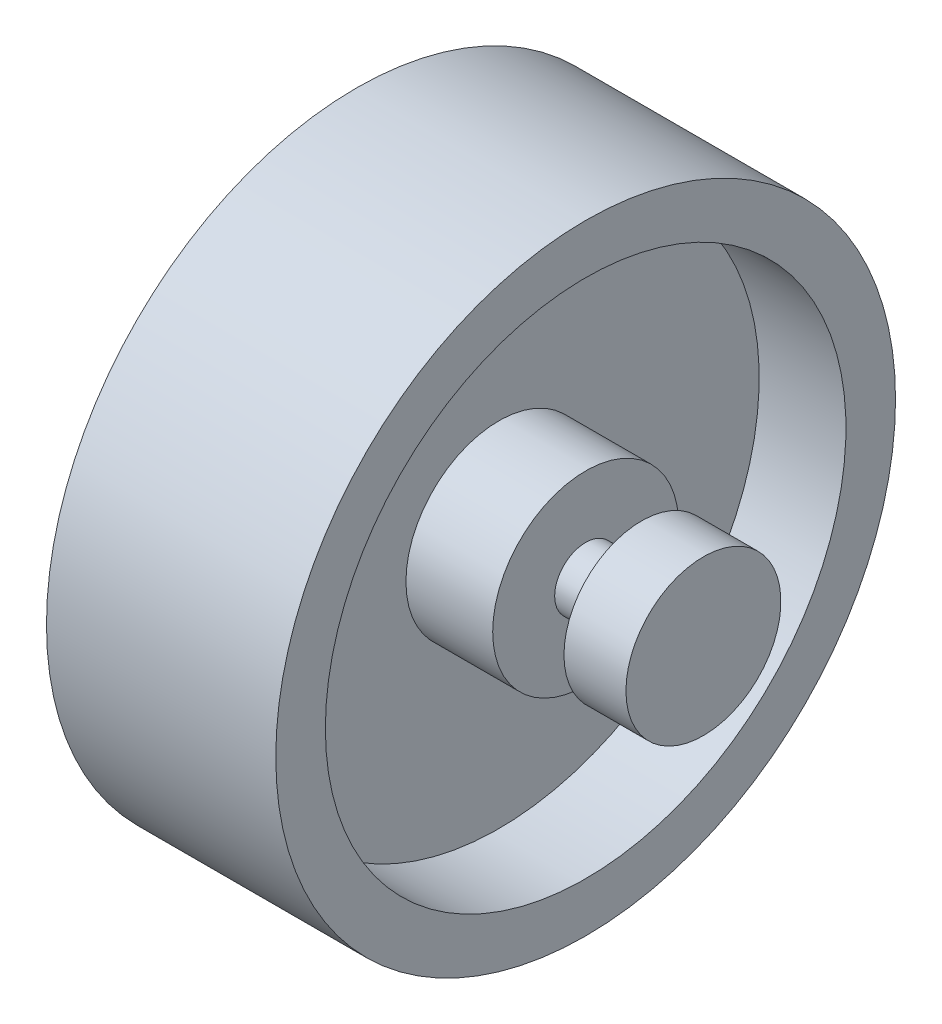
ISO-10303-21;
HEADER;
FILE_DESCRIPTION(('STEP AP214'),'2;1');
FILE_NAME('part.step','',(''),(''),'','','');
FILE_SCHEMA(('AUTOMOTIVE_DESIGN { 1 0 10303 214 1 1 1 1 }'));
ENDSEC;
DATA;
#1=APPLICATION_CONTEXT('core data for automotive mechanical design processes');
#2=APPLICATION_PROTOCOL_DEFINITION('international standard','automotive_design',2000,#1);
#3=PRODUCT_CONTEXT('',#1,'mechanical');
#4=PRODUCT('Part','Part','',(#3));
#5=PRODUCT_RELATED_PRODUCT_CATEGORY('part','',(#4));
#6=PRODUCT_DEFINITION_FORMATION('','',#4);
#7=PRODUCT_DEFINITION_CONTEXT('part definition',#1,'design');
#8=PRODUCT_DEFINITION('design','',#6,#7);
#9=PRODUCT_DEFINITION_SHAPE('','',#8);
#10=(LENGTH_UNIT() NAMED_UNIT(*) SI_UNIT(.MILLI.,.METRE.));
#11=(NAMED_UNIT(*) PLANE_ANGLE_UNIT() SI_UNIT($,.RADIAN.));
#12=(NAMED_UNIT(*) SI_UNIT($,.STERADIAN.) SOLID_ANGLE_UNIT());
#13=UNCERTAINTY_MEASURE_WITH_UNIT(LENGTH_MEASURE(1.E-05),#10,'distance_accuracy_value','');
#14=(GEOMETRIC_REPRESENTATION_CONTEXT(3) GLOBAL_UNCERTAINTY_ASSIGNED_CONTEXT((#13)) GLOBAL_UNIT_ASSIGNED_CONTEXT((#10,
#11,#12)) REPRESENTATION_CONTEXT('',''));
#15=CARTESIAN_POINT('',(0.,0.,0.));
#16=DIRECTION('',(0.,0.,1.));
#17=DIRECTION('',(1.,0.,0.));
#18=AXIS2_PLACEMENT_3D('',#15,#16,#17);
#19=CARTESIAN_POINT('',(-37.5000000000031,12.4999999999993,0.));
#20=DIRECTION('',(1.00000000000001,0.,0.));
#21=DIRECTION('',(0.,0.,-1.00000000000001));
#22=AXIS2_PLACEMENT_3D('',#19,#20,#21);
#23=PLANE('',#22);
#24=CARTESIAN_POINT('',(-37.5000000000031,0.,2.08166817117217E-13));
#25=DIRECTION('',(-1.00000000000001,0.,0.));
#26=DIRECTION('',(0.,0.,1.00000000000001));
#27=AXIS2_PLACEMENT_3D('',#24,#25,#26);
#28=CIRCLE('',#27,12.5);
#29=CARTESIAN_POINT('',(-37.5000000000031,0.,12.5000000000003));
#30=VERTEX_POINT('',#29);
#31=EDGE_CURVE('E10',#30,#30,#28,.T.);
#32=ORIENTED_EDGE('',*,*,#31,.T.);
#33=EDGE_LOOP('',(#32));
#34=FACE_BOUND('',#33,.T.);
#35=ADVANCED_FACE('F38',(#34),#23,.F.);
#36=CARTESIAN_POINT('',(-37.5000000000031,0.,2.08166817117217E-13));
#37=DIRECTION('',(-1.00000000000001,0.,0.));
#38=DIRECTION('',(0.,0.,1.00000000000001));
#39=AXIS2_PLACEMENT_3D('',#36,#37,#38);
#40=CYLINDRICAL_SURFACE('',#39,12.5);
#41=ORIENTED_EDGE('',*,*,#31,.F.);
#42=EDGE_LOOP('',(#41));
#43=FACE_BOUND('',#42,.T.);
#44=CARTESIAN_POINT('',(-27.5000000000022,2.22044604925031E-13,0.));
#45=DIRECTION('',(-1.00000000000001,0.,0.));
#46=DIRECTION('',(0.,0.,1.00000000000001));
#47=AXIS2_PLACEMENT_3D('',#44,#45,#46);
#48=CIRCLE('',#47,12.5);
#49=CARTESIAN_POINT('',(-27.5000000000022,2.06258621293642E-13,12.5000000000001));
#50=VERTEX_POINT('',#49);
#51=EDGE_CURVE('E45',#50,#50,#48,.T.);
#52=ORIENTED_EDGE('',*,*,#51,.T.);
#53=EDGE_LOOP('',(#52));
#54=FACE_BOUND('',#53,.T.);
#55=ADVANCED_FACE('F130',(#43,#54),#40,.T.);
#56=CARTESIAN_POINT('',(-27.5000000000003,4.99999999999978,0.));
#57=DIRECTION('',(-1.00000000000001,0.,0.));
#58=DIRECTION('',(0.,0.,1.00000000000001));
#59=AXIS2_PLACEMENT_3D('',#56,#57,#58);
#60=PLANE('',#59);
#61=ORIENTED_EDGE('',*,*,#51,.F.);
#62=EDGE_LOOP('',(#61));
#63=FACE_BOUND('',#62,.T.);
#64=CARTESIAN_POINT('',(-27.5000000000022,2.22044604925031E-13,0.));
#65=DIRECTION('',(-1.00000000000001,0.,0.));
#66=DIRECTION('',(0.,0.,1.00000000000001));
#67=AXIS2_PLACEMENT_3D('',#64,#65,#66);
#68=CIRCLE('',#67,5.);
#69=CARTESIAN_POINT('',(-27.5000000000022,2.15730211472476E-13,5.00000000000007));
#70=VERTEX_POINT('',#69);
#71=EDGE_CURVE('E52',#70,#70,#68,.T.);
#72=ORIENTED_EDGE('',*,*,#71,.T.);
#73=EDGE_LOOP('',(#72));
#74=FACE_BOUND('',#73,.T.);
#75=ADVANCED_FACE('F134',(#63,#74),#60,.F.);
#76=CARTESIAN_POINT('',(-37.5000000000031,0.,2.08166817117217E-13));
#77=DIRECTION('',(-1.00000000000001,0.,0.));
#78=DIRECTION('',(0.,0.,1.00000000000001));
#79=AXIS2_PLACEMENT_3D('',#76,#77,#78);
#80=CYLINDRICAL_SURFACE('',#79,5.);
#81=ORIENTED_EDGE('',*,*,#71,.F.);
#82=EDGE_LOOP('',(#81));
#83=FACE_BOUND('',#82,.T.);
#84=CARTESIAN_POINT('',(-18.4999999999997,0.,3.88578058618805E-13));
#85=DIRECTION('',(-1.00000000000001,0.,0.));
#86=DIRECTION('',(0.,0.,1.00000000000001));
#87=AXIS2_PLACEMENT_3D('',#84,#85,#86);
#88=CIRCLE('',#87,5.);
#89=CARTESIAN_POINT('',(-18.4999999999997,0.,5.00000000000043));
#90=VERTEX_POINT('',#89);
#91=EDGE_CURVE('E59',#90,#90,#88,.T.);
#92=ORIENTED_EDGE('',*,*,#91,.T.);
#93=EDGE_LOOP('',(#92));
#94=FACE_BOUND('',#93,.T.);
#95=ADVANCED_FACE('F139',(#83,#94),#80,.T.);
#96=CARTESIAN_POINT('',(-18.5,14.9999999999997,3.7470027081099E-13));
#97=DIRECTION('',(1.00000000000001,0.,0.));
#98=DIRECTION('',(0.,0.,-1.00000000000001));
#99=AXIS2_PLACEMENT_3D('',#96,#97,#98);
#100=PLANE('',#99);
#101=ORIENTED_EDGE('',*,*,#91,.F.);
#102=EDGE_LOOP('',(#101));
#103=FACE_BOUND('',#102,.T.);
#104=CARTESIAN_POINT('',(-18.4999999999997,0.,3.88578058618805E-13));
#105=DIRECTION('',(-1.00000000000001,0.,0.));
#106=DIRECTION('',(0.,0.,1.00000000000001));
#107=AXIS2_PLACEMENT_3D('',#104,#105,#106);
#108=CIRCLE('',#107,15.);
#109=CARTESIAN_POINT('',(-18.4999999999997,0.,15.0000000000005));
#110=VERTEX_POINT('',#109);
#111=EDGE_CURVE('E65',#110,#110,#108,.T.);
#112=ORIENTED_EDGE('',*,*,#111,.T.);
#113=EDGE_LOOP('',(#112));
#114=FACE_BOUND('',#113,.T.);
#115=ADVANCED_FACE('F145',(#103,#114),#100,.F.);
#116=CARTESIAN_POINT('',(-37.5000000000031,0.,2.08166817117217E-13));
#117=DIRECTION('',(-1.00000000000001,0.,0.));
#118=DIRECTION('',(0.,0.,1.00000000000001));
#119=AXIS2_PLACEMENT_3D('',#116,#117,#118);
#120=CYLINDRICAL_SURFACE('',#119,15.);
#121=ORIENTED_EDGE('',*,*,#111,.F.);
#122=EDGE_LOOP('',(#121));
#123=FACE_BOUND('',#122,.T.);
#124=CARTESIAN_POINT('',(-4.50000000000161,0.,1.52655665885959E-13));
#125=DIRECTION('',(-1.00000000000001,0.,0.));
#126=DIRECTION('',(0.,0.,1.00000000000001));
#127=AXIS2_PLACEMENT_3D('',#124,#125,#126);
#128=CIRCLE('',#127,15.);
#129=CARTESIAN_POINT('',(-4.50000000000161,0.,15.0000000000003));
#130=VERTEX_POINT('',#129);
#131=EDGE_CURVE('E68',#130,#130,#128,.T.);
#132=ORIENTED_EDGE('',*,*,#131,.T.);
#133=EDGE_LOOP('',(#132));
#134=FACE_BOUND('',#133,.T.);
#135=ADVANCED_FACE('F149',(#123,#134),#120,.T.);
#136=CARTESIAN_POINT('',(-4.50000000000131,42.0000000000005,0.));
#137=DIRECTION('',(1.00000000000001,0.,0.));
#138=DIRECTION('',(0.,0.,-1.00000000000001));
#139=AXIS2_PLACEMENT_3D('',#136,#137,#138);
#140=PLANE('',#139);
#141=ORIENTED_EDGE('',*,*,#131,.F.);
#142=EDGE_LOOP('',(#141));
#143=FACE_BOUND('',#142,.T.);
#144=CARTESIAN_POINT('',(-4.50000000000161,0.,1.52655665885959E-13));
#145=DIRECTION('',(-1.00000000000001,0.,0.));
#146=DIRECTION('',(0.,0.,1.00000000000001));
#147=AXIS2_PLACEMENT_3D('',#144,#145,#146);
#148=CIRCLE('',#147,42.);
#149=CARTESIAN_POINT('',(-4.50000000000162,0.,42.0000000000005));
#150=VERTEX_POINT('',#149);
#151=EDGE_CURVE('E72',#150,#150,#148,.T.);
#152=ORIENTED_EDGE('',*,*,#151,.T.);
#153=EDGE_LOOP('',(#152));
#154=FACE_BOUND('',#153,.T.);
#155=ADVANCED_FACE('F153',(#143,#154),#140,.F.);
#156=CARTESIAN_POINT('',(-37.5000000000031,0.,2.08166817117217E-13));
#157=DIRECTION('',(-1.00000000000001,0.,0.));
#158=DIRECTION('',(0.,0.,1.00000000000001));
#159=AXIS2_PLACEMENT_3D('',#156,#157,#158);
#160=CYLINDRICAL_SURFACE('',#159,42.);
#161=ORIENTED_EDGE('',*,*,#151,.F.);
#162=EDGE_LOOP('',(#161));
#163=FACE_BOUND('',#162,.T.);
#164=CARTESIAN_POINT('',(-18.4999999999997,0.,3.88578058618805E-13));
#165=DIRECTION('',(-1.00000000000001,0.,0.));
#166=DIRECTION('',(0.,0.,1.00000000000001));
#167=AXIS2_PLACEMENT_3D('',#164,#165,#166);
#168=CIRCLE('',#167,42.);
#169=CARTESIAN_POINT('',(-18.4999999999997,0.,42.0000000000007));
#170=VERTEX_POINT('',#169);
#171=EDGE_CURVE('E76',#170,#170,#168,.T.);
#172=ORIENTED_EDGE('',*,*,#171,.T.);
#173=EDGE_LOOP('',(#172));
#174=FACE_BOUND('',#173,.T.);
#175=ADVANCED_FACE('F157',(#163,#174),#160,.F.);
#176=CARTESIAN_POINT('',(-18.5000000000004,50.0000000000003,3.88578058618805E-13));
#177=DIRECTION('',(1.00000000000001,0.,0.));
#178=DIRECTION('',(0.,0.,-1.00000000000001));
#179=AXIS2_PLACEMENT_3D('',#176,#177,#178);
#180=PLANE('',#179);
#181=ORIENTED_EDGE('',*,*,#171,.F.);
#182=EDGE_LOOP('',(#181));
#183=FACE_BOUND('',#182,.T.);
#184=CARTESIAN_POINT('',(-18.4999999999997,0.,3.88578058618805E-13));
#185=DIRECTION('',(-1.00000000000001,0.,0.));
#186=DIRECTION('',(0.,0.,1.00000000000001));
#187=AXIS2_PLACEMENT_3D('',#184,#185,#186);
#188=CIRCLE('',#187,50.);
#189=CARTESIAN_POINT('',(-18.4999999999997,0.,50.0000000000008));
#190=VERTEX_POINT('',#189);
#191=EDGE_CURVE('E80',#190,#190,#188,.T.);
#192=ORIENTED_EDGE('',*,*,#191,.T.);
#193=EDGE_LOOP('',(#192));
#194=FACE_BOUND('',#193,.T.);
#195=ADVANCED_FACE('F161',(#183,#194),#180,.F.);
#196=CARTESIAN_POINT('',(-37.5000000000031,0.,2.08166817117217E-13));
#197=DIRECTION('',(-1.00000000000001,0.,0.));
#198=DIRECTION('',(0.,0.,1.00000000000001));
#199=AXIS2_PLACEMENT_3D('',#196,#197,#198);
#200=CYLINDRICAL_SURFACE('',#199,50.);
#201=ORIENTED_EDGE('',*,*,#191,.F.);
#202=EDGE_LOOP('',(#201));
#203=FACE_BOUND('',#202,.T.);
#204=CARTESIAN_POINT('',(18.4999999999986,0.,2.08166817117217E-13));
#205=DIRECTION('',(-1.00000000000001,0.,0.));
#206=DIRECTION('',(0.,0.,1.00000000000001));
#207=AXIS2_PLACEMENT_3D('',#204,#205,#206);
#208=CIRCLE('',#207,50.);
#209=CARTESIAN_POINT('',(18.4999999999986,0.,50.0000000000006));
#210=VERTEX_POINT('',#209);
#211=EDGE_CURVE('E84',#210,#210,#208,.T.);
#212=ORIENTED_EDGE('',*,*,#211,.T.);
#213=EDGE_LOOP('',(#212));
#214=FACE_BOUND('',#213,.T.);
#215=ADVANCED_FACE('F165',(#203,#214),#200,.T.);
#216=CARTESIAN_POINT('',(18.4999999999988,42.0000000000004,0.));
#217=DIRECTION('',(-1.00000000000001,0.,0.));
#218=DIRECTION('',(0.,0.,1.00000000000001));
#219=AXIS2_PLACEMENT_3D('',#216,#217,#218);
#220=PLANE('',#219);
#221=ORIENTED_EDGE('',*,*,#211,.F.);
#222=EDGE_LOOP('',(#221));
#223=FACE_BOUND('',#222,.T.);
#224=CARTESIAN_POINT('',(18.4999999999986,0.,2.08166817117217E-13));
#225=DIRECTION('',(-1.00000000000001,0.,0.));
#226=DIRECTION('',(0.,0.,1.00000000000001));
#227=AXIS2_PLACEMENT_3D('',#224,#225,#226);
#228=CIRCLE('',#227,42.);
#229=CARTESIAN_POINT('',(18.4999999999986,0.,42.0000000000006));
#230=VERTEX_POINT('',#229);
#231=EDGE_CURVE('E88',#230,#230,#228,.T.);
#232=ORIENTED_EDGE('',*,*,#231,.T.);
#233=EDGE_LOOP('',(#232));
#234=FACE_BOUND('',#233,.T.);
#235=ADVANCED_FACE('F169',(#223,#234),#220,.F.);
#236=CARTESIAN_POINT('',(-37.5000000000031,0.,2.08166817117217E-13));
#237=DIRECTION('',(-1.00000000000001,0.,0.));
#238=DIRECTION('',(0.,0.,1.00000000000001));
#239=AXIS2_PLACEMENT_3D('',#236,#237,#238);
#240=CYLINDRICAL_SURFACE('',#239,42.);
#241=ORIENTED_EDGE('',*,*,#231,.F.);
#242=EDGE_LOOP('',(#241));
#243=FACE_BOUND('',#242,.T.);
#244=CARTESIAN_POINT('',(4.49999999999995,3.33066907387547E-13,3.05311331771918E-13));
#245=DIRECTION('',(-1.00000000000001,0.,0.));
#246=DIRECTION('',(0.,0.,1.00000000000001));
#247=AXIS2_PLACEMENT_3D('',#244,#245,#246);
#248=CIRCLE('',#247,42.);
#249=CARTESIAN_POINT('',(4.49999999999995,2.8002600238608E-13,42.0000000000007));
#250=VERTEX_POINT('',#249);
#251=EDGE_CURVE('E92',#250,#250,#248,.T.);
#252=ORIENTED_EDGE('',*,*,#251,.T.);
#253=EDGE_LOOP('',(#252));
#254=FACE_BOUND('',#253,.T.);
#255=ADVANCED_FACE('F173',(#243,#254),#240,.F.);
#256=CARTESIAN_POINT('',(4.5,42.0000000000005,0.));
#257=DIRECTION('',(-1.00000000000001,0.,0.));
#258=DIRECTION('',(0.,0.,1.00000000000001));
#259=AXIS2_PLACEMENT_3D('',#256,#257,#258);
#260=PLANE('',#259);
#261=ORIENTED_EDGE('',*,*,#251,.F.);
#262=EDGE_LOOP('',(#261));
#263=FACE_BOUND('',#262,.T.);
#264=CARTESIAN_POINT('',(4.49999999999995,3.33066907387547E-13,3.05311331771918E-13));
#265=DIRECTION('',(-1.00000000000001,0.,0.));
#266=DIRECTION('',(0.,0.,1.00000000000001));
#267=AXIS2_PLACEMENT_3D('',#264,#265,#266);
#268=CIRCLE('',#267,15.);
#269=CARTESIAN_POINT('',(4.49999999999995,3.1412372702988E-13,15.0000000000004));
#270=VERTEX_POINT('',#269);
#271=EDGE_CURVE('E96',#270,#270,#268,.T.);
#272=ORIENTED_EDGE('',*,*,#271,.T.);
#273=EDGE_LOOP('',(#272));
#274=FACE_BOUND('',#273,.T.);
#275=ADVANCED_FACE('F177',(#263,#274),#260,.F.);
#276=CARTESIAN_POINT('',(-37.5000000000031,0.,2.08166817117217E-13));
#277=DIRECTION('',(-1.00000000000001,0.,0.));
#278=DIRECTION('',(0.,0.,1.00000000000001));
#279=AXIS2_PLACEMENT_3D('',#276,#277,#278);
#280=CYLINDRICAL_SURFACE('',#279,15.);
#281=ORIENTED_EDGE('',*,*,#271,.F.);
#282=EDGE_LOOP('',(#281));
#283=FACE_BOUND('',#282,.T.);
#284=CARTESIAN_POINT('',(18.4999999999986,0.,2.08166817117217E-13));
#285=DIRECTION('',(-1.00000000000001,0.,0.));
#286=DIRECTION('',(0.,0.,1.00000000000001));
#287=AXIS2_PLACEMENT_3D('',#284,#285,#286);
#288=CIRCLE('',#287,15.);
#289=CARTESIAN_POINT('',(18.4999999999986,0.,15.0000000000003));
#290=VERTEX_POINT('',#289);
#291=EDGE_CURVE('E99',#290,#290,#288,.T.);
#292=ORIENTED_EDGE('',*,*,#291,.T.);
#293=EDGE_LOOP('',(#292));
#294=FACE_BOUND('',#293,.T.);
#295=ADVANCED_FACE('F181',(#283,#294),#280,.T.);
#296=CARTESIAN_POINT('',(18.4999999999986,4.99999999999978,1.80411241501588E-13));
#297=DIRECTION('',(-1.00000000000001,0.,0.));
#298=DIRECTION('',(0.,0.,1.00000000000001));
#299=AXIS2_PLACEMENT_3D('',#296,#297,#298);
#300=PLANE('',#299);
#301=ORIENTED_EDGE('',*,*,#291,.F.);
#302=EDGE_LOOP('',(#301));
#303=FACE_BOUND('',#302,.T.);
#304=CARTESIAN_POINT('',(18.4999999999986,0.,2.08166817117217E-13));
#305=DIRECTION('',(-1.00000000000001,0.,0.));
#306=DIRECTION('',(0.,0.,1.00000000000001));
#307=AXIS2_PLACEMENT_3D('',#304,#305,#306);
#308=CIRCLE('',#307,5.00000000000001);
#309=CARTESIAN_POINT('',(18.4999999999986,0.,5.00000000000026));
#310=VERTEX_POINT('',#309);
#311=EDGE_CURVE('E103',#310,#310,#308,.T.);
#312=ORIENTED_EDGE('',*,*,#311,.T.);
#313=EDGE_LOOP('',(#312));
#314=FACE_BOUND('',#313,.T.);
#315=ADVANCED_FACE('F185',(#303,#314),#300,.F.);
#316=CARTESIAN_POINT('',(-37.5000000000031,0.,2.08166817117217E-13));
#317=DIRECTION('',(-1.00000000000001,0.,0.));
#318=DIRECTION('',(0.,0.,1.00000000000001));
#319=AXIS2_PLACEMENT_3D('',#316,#317,#318);
#320=CYLINDRICAL_SURFACE('',#319,5.00000000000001);
#321=ORIENTED_EDGE('',*,*,#311,.F.);
#322=EDGE_LOOP('',(#321));
#323=FACE_BOUND('',#322,.T.);
#324=CARTESIAN_POINT('',(27.4999999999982,2.22044604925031E-13,4.44089209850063E-13));
#325=DIRECTION('',(-1.00000000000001,0.,0.));
#326=DIRECTION('',(0.,0.,1.00000000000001));
#327=AXIS2_PLACEMENT_3D('',#324,#325,#326);
#328=CIRCLE('',#327,5.00000000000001);
#329=CARTESIAN_POINT('',(27.4999999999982,2.15730211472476E-13,5.00000000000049));
#330=VERTEX_POINT('',#329);
#331=EDGE_CURVE('E106',#330,#330,#328,.T.);
#332=ORIENTED_EDGE('',*,*,#331,.T.);
#333=EDGE_LOOP('',(#332));
#334=FACE_BOUND('',#333,.T.);
#335=ADVANCED_FACE('F189',(#323,#334),#320,.T.);
#336=CARTESIAN_POINT('',(27.4999999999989,12.5000000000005,4.44089209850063E-13));
#337=DIRECTION('',(1.00000000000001,0.,0.));
#338=DIRECTION('',(0.,0.,-1.00000000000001));
#339=AXIS2_PLACEMENT_3D('',#336,#337,#338);
#340=PLANE('',#339);
#341=ORIENTED_EDGE('',*,*,#331,.F.);
#342=EDGE_LOOP('',(#341));
#343=FACE_BOUND('',#342,.T.);
#344=CARTESIAN_POINT('',(27.4999999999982,2.22044604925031E-13,4.44089209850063E-13));
#345=DIRECTION('',(-1.00000000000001,0.,0.));
#346=DIRECTION('',(0.,0.,1.00000000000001));
#347=AXIS2_PLACEMENT_3D('',#344,#345,#346);
#348=CIRCLE('',#347,12.5);
#349=CARTESIAN_POINT('',(27.4999999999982,2.06258621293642E-13,12.5000000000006));
#350=VERTEX_POINT('',#349);
#351=EDGE_CURVE('E110',#350,#350,#348,.T.);
#352=ORIENTED_EDGE('',*,*,#351,.T.);
#353=EDGE_LOOP('',(#352));
#354=FACE_BOUND('',#353,.T.);
#355=ADVANCED_FACE('F126',(#343,#354),#340,.F.);
#356=CARTESIAN_POINT('',(-37.5000000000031,0.,2.08166817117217E-13));
#357=DIRECTION('',(-1.00000000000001,0.,0.));
#358=DIRECTION('',(0.,0.,1.00000000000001));
#359=AXIS2_PLACEMENT_3D('',#356,#357,#358);
#360=CYLINDRICAL_SURFACE('',#359,12.5);
#361=ORIENTED_EDGE('',*,*,#351,.F.);
#362=EDGE_LOOP('',(#361));
#363=FACE_BOUND('',#362,.T.);
#364=CARTESIAN_POINT('',(37.4999999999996,-3.33066907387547E-13,4.02455846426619E-13));
#365=DIRECTION('',(-1.00000000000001,0.,0.));
#366=DIRECTION('',(0.,0.,1.00000000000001));
#367=AXIS2_PLACEMENT_3D('',#364,#365,#366);
#368=CIRCLE('',#367,12.5);
#369=CARTESIAN_POINT('',(37.4999999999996,-3.48852891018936E-13,12.5000000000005));
#370=VERTEX_POINT('',#369);
#371=EDGE_CURVE('E114',#370,#370,#368,.T.);
#372=ORIENTED_EDGE('',*,*,#371,.T.);
#373=EDGE_LOOP('',(#372));
#374=FACE_BOUND('',#373,.T.);
#375=ADVANCED_FACE('F118',(#363,#374),#360,.T.);
#376=CARTESIAN_POINT('',(37.4999999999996,-3.33066907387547E-13,4.02455846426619E-13));
#377=DIRECTION('',(-1.00000000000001,0.,0.));
#378=DIRECTION('',(0.,0.,1.00000000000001));
#379=AXIS2_PLACEMENT_3D('',#376,#377,#378);
#380=PLANE('',#379);
#381=ORIENTED_EDGE('',*,*,#371,.F.);
#382=EDGE_LOOP('',(#381));
#383=FACE_BOUND('',#382,.T.);
#384=ADVANCED_FACE('F120',(#383),#380,.F.);
#385=CLOSED_SHELL('',(#35,#55,#75,#95,#115,#135,#155,#175,#195,#215,#235,#255,#275,#295,#315,
#335,#355,#375,#384));
#386=MANIFOLD_SOLID_BREP('B2',#385);
#387=ADVANCED_BREP_SHAPE_REPRESENTATION('',(#18,#386),#14);
#388=SHAPE_DEFINITION_REPRESENTATION(#9,#387);
ENDSEC;
END-ISO-10303-21;
